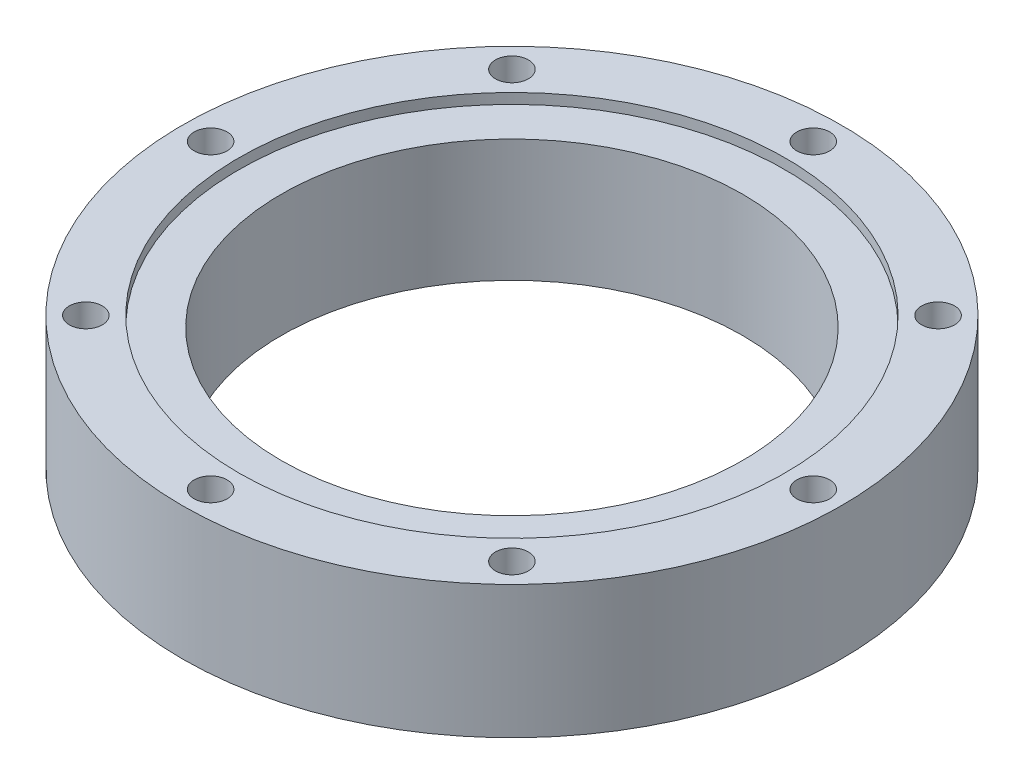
ISO-10303-21;
HEADER;
FILE_DESCRIPTION(('STEP AP214'),'2;1');
FILE_NAME('part.step','',(''),(''),'','','');
FILE_SCHEMA(('AUTOMOTIVE_DESIGN { 1 0 10303 214 1 1 1 1 }'));
ENDSEC;
DATA;
#1=APPLICATION_CONTEXT('core data for automotive mechanical design processes');
#2=APPLICATION_PROTOCOL_DEFINITION('international standard','automotive_design',2000,#1);
#3=PRODUCT_CONTEXT('',#1,'mechanical');
#4=PRODUCT('Part','Part','',(#3));
#5=PRODUCT_RELATED_PRODUCT_CATEGORY('part','',(#4));
#6=PRODUCT_DEFINITION_FORMATION('','',#4);
#7=PRODUCT_DEFINITION_CONTEXT('part definition',#1,'design');
#8=PRODUCT_DEFINITION('design','',#6,#7);
#9=PRODUCT_DEFINITION_SHAPE('','',#8);
#10=(LENGTH_UNIT() NAMED_UNIT(*) SI_UNIT(.MILLI.,.METRE.));
#11=(NAMED_UNIT(*) PLANE_ANGLE_UNIT() SI_UNIT($,.RADIAN.));
#12=(NAMED_UNIT(*) SI_UNIT($,.STERADIAN.) SOLID_ANGLE_UNIT());
#13=UNCERTAINTY_MEASURE_WITH_UNIT(LENGTH_MEASURE(1.E-05),#10,'distance_accuracy_value','');
#14=(GEOMETRIC_REPRESENTATION_CONTEXT(3) GLOBAL_UNCERTAINTY_ASSIGNED_CONTEXT((#13)) GLOBAL_UNIT_ASSIGNED_CONTEXT((#10,
#11,#12)) REPRESENTATION_CONTEXT('',''));
#15=CARTESIAN_POINT('',(0.,0.,0.));
#16=DIRECTION('',(0.,0.,1.));
#17=DIRECTION('',(1.,0.,0.));
#18=AXIS2_PLACEMENT_3D('',#15,#16,#17);
#19=CARTESIAN_POINT('',(0.,14.1,0.));
#20=DIRECTION('',(0.,1.,0.));
#21=DIRECTION('',(0.,0.,1.));
#22=AXIS2_PLACEMENT_3D('',#19,#20,#21);
#23=PLANE('',#22);
#24=CARTESIAN_POINT('',(0.,14.1,-32.));
#25=DIRECTION('',(0.,1.,0.));
#26=DIRECTION('',(0.,0.,1.));
#27=AXIS2_PLACEMENT_3D('',#24,#25,#26);
#28=CIRCLE('',#27,1.75);
#29=CARTESIAN_POINT('',(0.,14.1,-30.25));
#30=VERTEX_POINT('',#29);
#31=EDGE_CURVE('E133',#30,#30,#28,.T.);
#32=ORIENTED_EDGE('',*,*,#31,.F.);
#33=EDGE_LOOP('',(#32));
#34=FACE_BOUND('',#33,.T.);
#35=CARTESIAN_POINT('',(22.6274169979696,14.1,-22.6274169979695));
#36=DIRECTION('',(0.,1.,0.));
#37=DIRECTION('',(0.,0.,1.));
#38=AXIS2_PLACEMENT_3D('',#35,#36,#37);
#39=CIRCLE('',#38,1.75);
#40=CARTESIAN_POINT('',(22.6274169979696,14.1,-20.8774169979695));
#41=VERTEX_POINT('',#40);
#42=EDGE_CURVE('E130',#41,#41,#39,.T.);
#43=ORIENTED_EDGE('',*,*,#42,.F.);
#44=EDGE_LOOP('',(#43));
#45=FACE_BOUND('',#44,.T.);
#46=CARTESIAN_POINT('',(32.,14.1,1.1172740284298E-13));
#47=DIRECTION('',(0.,1.,0.));
#48=DIRECTION('',(0.,0.,1.));
#49=AXIS2_PLACEMENT_3D('',#46,#47,#48);
#50=CIRCLE('',#49,1.75);
#51=CARTESIAN_POINT('',(32.,14.1,1.75000000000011));
#52=VERTEX_POINT('',#51);
#53=EDGE_CURVE('E119',#52,#52,#50,.T.);
#54=ORIENTED_EDGE('',*,*,#53,.F.);
#55=EDGE_LOOP('',(#54));
#56=FACE_BOUND('',#55,.T.);
#57=CARTESIAN_POINT('',(22.6274169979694,14.1,22.6274169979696));
#58=DIRECTION('',(0.,1.,0.));
#59=DIRECTION('',(0.,0.,1.));
#60=AXIS2_PLACEMENT_3D('',#57,#58,#59);
#61=CIRCLE('',#60,1.75);
#62=CARTESIAN_POINT('',(22.6274169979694,14.1,24.3774169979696));
#63=VERTEX_POINT('',#62);
#64=EDGE_CURVE('E112',#63,#63,#61,.T.);
#65=ORIENTED_EDGE('',*,*,#64,.F.);
#66=EDGE_LOOP('',(#65));
#67=FACE_BOUND('',#66,.T.);
#68=CARTESIAN_POINT('',(-2.23454805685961E-13,14.1,32.));
#69=DIRECTION('',(0.,1.,0.));
#70=DIRECTION('',(0.,0.,1.));
#71=AXIS2_PLACEMENT_3D('',#68,#69,#70);
#72=CIRCLE('',#71,1.75);
#73=CARTESIAN_POINT('',(-2.23454805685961E-13,14.1,33.75));
#74=VERTEX_POINT('',#73);
#75=EDGE_CURVE('E103',#74,#74,#72,.T.);
#76=ORIENTED_EDGE('',*,*,#75,.F.);
#77=EDGE_LOOP('',(#76));
#78=FACE_BOUND('',#77,.T.);
#79=CARTESIAN_POINT('',(-22.6274169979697,14.1,22.6274169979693));
#80=DIRECTION('',(0.,1.,0.));
#81=DIRECTION('',(0.,0.,1.));
#82=AXIS2_PLACEMENT_3D('',#79,#80,#81);
#83=CIRCLE('',#82,1.75);
#84=CARTESIAN_POINT('',(-22.6274169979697,14.1,24.3774169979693));
#85=VERTEX_POINT('',#84);
#86=EDGE_CURVE('E92',#85,#85,#83,.T.);
#87=ORIENTED_EDGE('',*,*,#86,.F.);
#88=EDGE_LOOP('',(#87));
#89=FACE_BOUND('',#88,.T.);
#90=CARTESIAN_POINT('',(-32.,14.1,-3.35182208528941E-13));
#91=DIRECTION('',(0.,1.,0.));
#92=DIRECTION('',(0.,0.,1.));
#93=AXIS2_PLACEMENT_3D('',#90,#91,#92);
#94=CIRCLE('',#93,1.75);
#95=CARTESIAN_POINT('',(-32.,14.1,1.74999999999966));
#96=VERTEX_POINT('',#95);
#97=EDGE_CURVE('E87',#96,#96,#94,.T.);
#98=ORIENTED_EDGE('',*,*,#97,.F.);
#99=EDGE_LOOP('',(#98));
#100=FACE_BOUND('',#99,.T.);
#101=CARTESIAN_POINT('',(-22.6274169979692,14.1,-22.6274169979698));
#102=DIRECTION('',(0.,1.,0.));
#103=DIRECTION('',(0.,0.,1.));
#104=AXIS2_PLACEMENT_3D('',#101,#102,#103);
#105=CIRCLE('',#104,1.75);
#106=CARTESIAN_POINT('',(-22.6274169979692,14.1,-20.8774169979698));
#107=VERTEX_POINT('',#106);
#108=EDGE_CURVE('E76',#107,#107,#105,.T.);
#109=ORIENTED_EDGE('',*,*,#108,.F.);
#110=EDGE_LOOP('',(#109));
#111=FACE_BOUND('',#110,.T.);
#112=CARTESIAN_POINT('',(0.,14.1,0.));
#113=DIRECTION('',(0.,1.,0.));
#114=DIRECTION('',(0.,0.,1.));
#115=AXIS2_PLACEMENT_3D('',#112,#113,#114);
#116=CIRCLE('',#115,35.);
#117=CARTESIAN_POINT('',(0.,14.1,35.));
#118=VERTEX_POINT('',#117);
#119=EDGE_CURVE('E60',#118,#118,#116,.T.);
#120=ORIENTED_EDGE('',*,*,#119,.T.);
#121=EDGE_LOOP('',(#120));
#122=FACE_BOUND('',#121,.T.);
#123=CARTESIAN_POINT('',(0.,14.1,0.));
#124=DIRECTION('',(0.,1.,0.));
#125=DIRECTION('',(0.,0.,1.));
#126=AXIS2_PLACEMENT_3D('',#123,#124,#125);
#127=CIRCLE('',#126,29.);
#128=CARTESIAN_POINT('',(0.,14.1,29.));
#129=VERTEX_POINT('',#128);
#130=EDGE_CURVE('E66',#129,#129,#127,.T.);
#131=ORIENTED_EDGE('',*,*,#130,.F.);
#132=EDGE_LOOP('',(#131));
#133=FACE_BOUND('',#132,.T.);
#134=ADVANCED_FACE('F47',(#34,#45,#56,#67,#78,#89,#100,#111,#122,#133),#23,.T.);
#135=CARTESIAN_POINT('',(0.,0.,0.));
#136=DIRECTION('',(0.,1.,0.));
#137=DIRECTION('',(0.,0.,1.));
#138=AXIS2_PLACEMENT_3D('',#135,#136,#137);
#139=PLANE('',#138);
#140=CARTESIAN_POINT('',(29.5641450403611,0.,12.245869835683));
#141=DIRECTION('',(0.,-1.,0.));
#142=DIRECTION('',(0.,0.,-1.));
#143=AXIS2_PLACEMENT_3D('',#140,#141,#142);
#144=CIRCLE('',#143,1.5);
#145=CARTESIAN_POINT('',(29.5641450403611,0.,10.745869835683));
#146=VERTEX_POINT('',#145);
#147=EDGE_CURVE('E152',#146,#146,#144,.T.);
#148=ORIENTED_EDGE('',*,*,#147,.F.);
#149=EDGE_LOOP('',(#148));
#150=FACE_BOUND('',#149,.T.);
#151=CARTESIAN_POINT('',(-29.5641450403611,0.,-12.245869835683));
#152=DIRECTION('',(0.,-1.,0.));
#153=DIRECTION('',(0.,0.,-1.));
#154=AXIS2_PLACEMENT_3D('',#151,#152,#153);
#155=CIRCLE('',#154,1.5);
#156=CARTESIAN_POINT('',(-29.5641450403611,0.,-13.745869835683));
#157=VERTEX_POINT('',#156);
#158=EDGE_CURVE('E147',#157,#157,#155,.T.);
#159=ORIENTED_EDGE('',*,*,#158,.F.);
#160=EDGE_LOOP('',(#159));
#161=FACE_BOUND('',#160,.T.);
#162=CARTESIAN_POINT('',(0.,0.,-32.));
#163=DIRECTION('',(0.,1.,0.));
#164=DIRECTION('',(0.,0.,1.));
#165=AXIS2_PLACEMENT_3D('',#162,#163,#164);
#166=CIRCLE('',#165,1.75);
#167=CARTESIAN_POINT('',(0.,0.,-30.25));
#168=VERTEX_POINT('',#167);
#169=EDGE_CURVE('E71',#168,#168,#166,.T.);
#170=ORIENTED_EDGE('',*,*,#169,.T.);
#171=EDGE_LOOP('',(#170));
#172=FACE_BOUND('',#171,.T.);
#173=CARTESIAN_POINT('',(22.6274169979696,0.,-22.6274169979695));
#174=DIRECTION('',(0.,1.,0.));
#175=DIRECTION('',(0.,0.,1.));
#176=AXIS2_PLACEMENT_3D('',#173,#174,#175);
#177=CIRCLE('',#176,1.75);
#178=CARTESIAN_POINT('',(22.6274169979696,0.,-20.8774169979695));
#179=VERTEX_POINT('',#178);
#180=EDGE_CURVE('E121',#179,#179,#177,.T.);
#181=ORIENTED_EDGE('',*,*,#180,.T.);
#182=EDGE_LOOP('',(#181));
#183=FACE_BOUND('',#182,.T.);
#184=CARTESIAN_POINT('',(32.,0.,1.1172740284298E-13));
#185=DIRECTION('',(0.,1.,0.));
#186=DIRECTION('',(0.,0.,1.));
#187=AXIS2_PLACEMENT_3D('',#184,#185,#186);
#188=CIRCLE('',#187,1.75);
#189=CARTESIAN_POINT('',(32.,0.,1.75000000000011));
#190=VERTEX_POINT('',#189);
#191=EDGE_CURVE('E113',#190,#190,#188,.T.);
#192=ORIENTED_EDGE('',*,*,#191,.T.);
#193=EDGE_LOOP('',(#192));
#194=FACE_BOUND('',#193,.T.);
#195=CARTESIAN_POINT('',(22.6274169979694,0.,22.6274169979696));
#196=DIRECTION('',(0.,1.,0.));
#197=DIRECTION('',(0.,0.,1.));
#198=AXIS2_PLACEMENT_3D('',#195,#196,#197);
#199=CIRCLE('',#198,1.75);
#200=CARTESIAN_POINT('',(22.6274169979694,0.,24.3774169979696));
#201=VERTEX_POINT('',#200);
#202=EDGE_CURVE('E110',#201,#201,#199,.T.);
#203=ORIENTED_EDGE('',*,*,#202,.T.);
#204=EDGE_LOOP('',(#203));
#205=FACE_BOUND('',#204,.T.);
#206=CARTESIAN_POINT('',(-2.23454805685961E-13,0.,32.));
#207=DIRECTION('',(0.,1.,0.));
#208=DIRECTION('',(0.,0.,1.));
#209=AXIS2_PLACEMENT_3D('',#206,#207,#208);
#210=CIRCLE('',#209,1.75);
#211=CARTESIAN_POINT('',(-2.23454805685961E-13,0.,33.75));
#212=VERTEX_POINT('',#211);
#213=EDGE_CURVE('E97',#212,#212,#210,.T.);
#214=ORIENTED_EDGE('',*,*,#213,.T.);
#215=EDGE_LOOP('',(#214));
#216=FACE_BOUND('',#215,.T.);
#217=CARTESIAN_POINT('',(-22.6274169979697,0.,22.6274169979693));
#218=DIRECTION('',(0.,1.,0.));
#219=DIRECTION('',(0.,0.,1.));
#220=AXIS2_PLACEMENT_3D('',#217,#218,#219);
#221=CIRCLE('',#220,1.75);
#222=CARTESIAN_POINT('',(-22.6274169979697,0.,24.3774169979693));
#223=VERTEX_POINT('',#222);
#224=EDGE_CURVE('E93',#223,#223,#221,.T.);
#225=ORIENTED_EDGE('',*,*,#224,.T.);
#226=EDGE_LOOP('',(#225));
#227=FACE_BOUND('',#226,.T.);
#228=CARTESIAN_POINT('',(-32.,0.,-3.35182208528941E-13));
#229=DIRECTION('',(0.,1.,0.));
#230=DIRECTION('',(0.,0.,1.));
#231=AXIS2_PLACEMENT_3D('',#228,#229,#230);
#232=CIRCLE('',#231,1.75);
#233=CARTESIAN_POINT('',(-32.,0.,1.74999999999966));
#234=VERTEX_POINT('',#233);
#235=EDGE_CURVE('E81',#234,#234,#232,.T.);
#236=ORIENTED_EDGE('',*,*,#235,.T.);
#237=EDGE_LOOP('',(#236));
#238=FACE_BOUND('',#237,.T.);
#239=CARTESIAN_POINT('',(-22.6274169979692,0.,-22.6274169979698));
#240=DIRECTION('',(0.,1.,0.));
#241=DIRECTION('',(0.,0.,1.));
#242=AXIS2_PLACEMENT_3D('',#239,#240,#241);
#243=CIRCLE('',#242,1.75);
#244=CARTESIAN_POINT('',(-22.6274169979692,0.,-20.8774169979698));
#245=VERTEX_POINT('',#244);
#246=EDGE_CURVE('E74',#245,#245,#243,.T.);
#247=ORIENTED_EDGE('',*,*,#246,.T.);
#248=EDGE_LOOP('',(#247));
#249=FACE_BOUND('',#248,.T.);
#250=CARTESIAN_POINT('',(0.,0.,0.));
#251=DIRECTION('',(0.,1.,0.));
#252=DIRECTION('',(0.,0.,1.));
#253=AXIS2_PLACEMENT_3D('',#250,#251,#252);
#254=CIRCLE('',#253,35.);
#255=CARTESIAN_POINT('',(0.,0.,35.));
#256=VERTEX_POINT('',#255);
#257=EDGE_CURVE('E65',#256,#256,#254,.T.);
#258=ORIENTED_EDGE('',*,*,#257,.F.);
#259=EDGE_LOOP('',(#258));
#260=FACE_BOUND('',#259,.T.);
#261=CARTESIAN_POINT('',(0.,0.,0.));
#262=DIRECTION('',(0.,1.,0.));
#263=DIRECTION('',(0.,0.,1.));
#264=AXIS2_PLACEMENT_3D('',#261,#262,#263);
#265=CIRCLE('',#264,24.5);
#266=CARTESIAN_POINT('',(0.,0.,-24.5));
#267=VERTEX_POINT('',#266);
#268=EDGE_CURVE('E136',#267,#267,#265,.T.);
#269=ORIENTED_EDGE('',*,*,#268,.T.);
#270=EDGE_LOOP('',(#269));
#271=FACE_BOUND('',#270,.T.);
#272=ADVANCED_FACE('F173',(#150,#161,#172,#183,#194,#205,#216,#227,#238,#249,#260,#271),#139,.F.);
#273=CARTESIAN_POINT('',(0.,14.1,0.));
#274=DIRECTION('',(0.,-1.,0.));
#275=DIRECTION('',(0.,0.,-1.));
#276=AXIS2_PLACEMENT_3D('',#273,#274,#275);
#277=CYLINDRICAL_SURFACE('',#276,35.);
#278=ORIENTED_EDGE('',*,*,#119,.F.);
#279=EDGE_LOOP('',(#278));
#280=FACE_BOUND('',#279,.T.);
#281=ORIENTED_EDGE('',*,*,#257,.T.);
#282=EDGE_LOOP('',(#281));
#283=FACE_BOUND('',#282,.T.);
#284=ADVANCED_FACE('F51',(#280,#283),#277,.T.);
#285=CARTESIAN_POINT('',(0.,14.1,0.));
#286=DIRECTION('',(0.,-1.,0.));
#287=DIRECTION('',(0.,0.,-1.));
#288=AXIS2_PLACEMENT_3D('',#285,#286,#287);
#289=CYLINDRICAL_SURFACE('',#288,29.);
#290=CARTESIAN_POINT('',(0.,13.,0.));
#291=DIRECTION('',(0.,1.,0.));
#292=DIRECTION('',(0.,0.,1.));
#293=AXIS2_PLACEMENT_3D('',#290,#291,#292);
#294=CIRCLE('',#293,29.);
#295=CARTESIAN_POINT('',(0.,13.,29.));
#296=VERTEX_POINT('',#295);
#297=EDGE_CURVE('E10',#296,#296,#294,.T.);
#298=ORIENTED_EDGE('',*,*,#297,.F.);
#299=EDGE_LOOP('',(#298));
#300=FACE_BOUND('',#299,.T.);
#301=ORIENTED_EDGE('',*,*,#130,.T.);
#302=EDGE_LOOP('',(#301));
#303=FACE_BOUND('',#302,.T.);
#304=ADVANCED_FACE('F218',(#300,#303),#289,.F.);
#305=CARTESIAN_POINT('',(-22.6274169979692,0.,-22.6274169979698));
#306=DIRECTION('',(0.,1.,0.));
#307=DIRECTION('',(0.,0.,1.));
#308=AXIS2_PLACEMENT_3D('',#305,#306,#307);
#309=CYLINDRICAL_SURFACE('',#308,1.75);
#310=ORIENTED_EDGE('',*,*,#246,.F.);
#311=EDGE_LOOP('',(#310));
#312=FACE_BOUND('',#311,.T.);
#313=ORIENTED_EDGE('',*,*,#108,.T.);
#314=EDGE_LOOP('',(#313));
#315=FACE_BOUND('',#314,.T.);
#316=ADVANCED_FACE('F225',(#312,#315),#309,.F.);
#317=CARTESIAN_POINT('',(-32.,0.,-3.35182208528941E-13));
#318=DIRECTION('',(0.,1.,0.));
#319=DIRECTION('',(0.,0.,1.));
#320=AXIS2_PLACEMENT_3D('',#317,#318,#319);
#321=CYLINDRICAL_SURFACE('',#320,1.75);
#322=ORIENTED_EDGE('',*,*,#235,.F.);
#323=EDGE_LOOP('',(#322));
#324=FACE_BOUND('',#323,.T.);
#325=ORIENTED_EDGE('',*,*,#97,.T.);
#326=EDGE_LOOP('',(#325));
#327=FACE_BOUND('',#326,.T.);
#328=ADVANCED_FACE('F228',(#324,#327),#321,.F.);
#329=CARTESIAN_POINT('',(-22.6274169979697,0.,22.6274169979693));
#330=DIRECTION('',(0.,1.,0.));
#331=DIRECTION('',(0.,0.,1.));
#332=AXIS2_PLACEMENT_3D('',#329,#330,#331);
#333=CYLINDRICAL_SURFACE('',#332,1.75);
#334=ORIENTED_EDGE('',*,*,#224,.F.);
#335=EDGE_LOOP('',(#334));
#336=FACE_BOUND('',#335,.T.);
#337=ORIENTED_EDGE('',*,*,#86,.T.);
#338=EDGE_LOOP('',(#337));
#339=FACE_BOUND('',#338,.T.);
#340=ADVANCED_FACE('F227',(#336,#339),#333,.F.);
#341=CARTESIAN_POINT('',(-2.23454805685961E-13,0.,32.));
#342=DIRECTION('',(0.,1.,0.));
#343=DIRECTION('',(0.,0.,1.));
#344=AXIS2_PLACEMENT_3D('',#341,#342,#343);
#345=CYLINDRICAL_SURFACE('',#344,1.75);
#346=ORIENTED_EDGE('',*,*,#213,.F.);
#347=EDGE_LOOP('',(#346));
#348=FACE_BOUND('',#347,.T.);
#349=ORIENTED_EDGE('',*,*,#75,.T.);
#350=EDGE_LOOP('',(#349));
#351=FACE_BOUND('',#350,.T.);
#352=ADVANCED_FACE('F232',(#348,#351),#345,.F.);
#353=CARTESIAN_POINT('',(22.6274169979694,0.,22.6274169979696));
#354=DIRECTION('',(0.,1.,0.));
#355=DIRECTION('',(0.,0.,1.));
#356=AXIS2_PLACEMENT_3D('',#353,#354,#355);
#357=CYLINDRICAL_SURFACE('',#356,1.75);
#358=ORIENTED_EDGE('',*,*,#202,.F.);
#359=EDGE_LOOP('',(#358));
#360=FACE_BOUND('',#359,.T.);
#361=ORIENTED_EDGE('',*,*,#64,.T.);
#362=EDGE_LOOP('',(#361));
#363=FACE_BOUND('',#362,.T.);
#364=ADVANCED_FACE('F236',(#360,#363),#357,.F.);
#365=CARTESIAN_POINT('',(32.,0.,1.1172740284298E-13));
#366=DIRECTION('',(0.,1.,0.));
#367=DIRECTION('',(0.,0.,1.));
#368=AXIS2_PLACEMENT_3D('',#365,#366,#367);
#369=CYLINDRICAL_SURFACE('',#368,1.75);
#370=ORIENTED_EDGE('',*,*,#191,.F.);
#371=EDGE_LOOP('',(#370));
#372=FACE_BOUND('',#371,.T.);
#373=ORIENTED_EDGE('',*,*,#53,.T.);
#374=EDGE_LOOP('',(#373));
#375=FACE_BOUND('',#374,.T.);
#376=ADVANCED_FACE('F245',(#372,#375),#369,.F.);
#377=CARTESIAN_POINT('',(22.6274169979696,0.,-22.6274169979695));
#378=DIRECTION('',(0.,1.,0.));
#379=DIRECTION('',(0.,0.,1.));
#380=AXIS2_PLACEMENT_3D('',#377,#378,#379);
#381=CYLINDRICAL_SURFACE('',#380,1.75);
#382=ORIENTED_EDGE('',*,*,#180,.F.);
#383=EDGE_LOOP('',(#382));
#384=FACE_BOUND('',#383,.T.);
#385=ORIENTED_EDGE('',*,*,#42,.T.);
#386=EDGE_LOOP('',(#385));
#387=FACE_BOUND('',#386,.T.);
#388=ADVANCED_FACE('F248',(#384,#387),#381,.F.);
#389=CARTESIAN_POINT('',(0.,0.,-32.));
#390=DIRECTION('',(0.,1.,0.));
#391=DIRECTION('',(0.,0.,1.));
#392=AXIS2_PLACEMENT_3D('',#389,#390,#391);
#393=CYLINDRICAL_SURFACE('',#392,1.75);
#394=ORIENTED_EDGE('',*,*,#169,.F.);
#395=EDGE_LOOP('',(#394));
#396=FACE_BOUND('',#395,.T.);
#397=ORIENTED_EDGE('',*,*,#31,.T.);
#398=EDGE_LOOP('',(#397));
#399=FACE_BOUND('',#398,.T.);
#400=ADVANCED_FACE('F208',(#396,#399),#393,.F.);
#401=CARTESIAN_POINT('',(0.,13.,0.));
#402=DIRECTION('',(0.,1.,0.));
#403=DIRECTION('',(0.,0.,1.));
#404=AXIS2_PLACEMENT_3D('',#401,#402,#403);
#405=PLANE('',#404);
#406=ORIENTED_EDGE('',*,*,#297,.T.);
#407=EDGE_LOOP('',(#406));
#408=FACE_BOUND('',#407,.T.);
#409=CARTESIAN_POINT('',(0.,13.,0.));
#410=DIRECTION('',(0.,1.,0.));
#411=DIRECTION('',(0.,0.,1.));
#412=AXIS2_PLACEMENT_3D('',#409,#410,#411);
#413=CIRCLE('',#412,24.5);
#414=CARTESIAN_POINT('',(0.,13.,-24.5));
#415=VERTEX_POINT('',#414);
#416=EDGE_CURVE('E79',#415,#415,#413,.T.);
#417=ORIENTED_EDGE('',*,*,#416,.F.);
#418=EDGE_LOOP('',(#417));
#419=FACE_BOUND('',#418,.T.);
#420=ADVANCED_FACE('F200',(#408,#419),#405,.T.);
#421=CARTESIAN_POINT('',(0.,13.,0.));
#422=DIRECTION('',(0.,-1.,0.));
#423=DIRECTION('',(0.,0.,-1.));
#424=AXIS2_PLACEMENT_3D('',#421,#422,#423);
#425=CYLINDRICAL_SURFACE('',#424,24.5);
#426=CARTESIAN_POINT('',(0.,13.,-24.5));
#427=CARTESIAN_POINT('',(0.,12.8645833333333,-24.5));
#428=CARTESIAN_POINT('',(0.,12.7291666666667,-24.5));
#429=CARTESIAN_POINT('',(0.,12.4583333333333,-24.5));
#430=CARTESIAN_POINT('',(0.,12.3229166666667,-24.5));
#431=CARTESIAN_POINT('',(0.,12.0520833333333,-24.5));
#432=CARTESIAN_POINT('',(0.,11.9166666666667,-24.5));
#433=CARTESIAN_POINT('',(0.,11.6458333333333,-24.5));
#434=CARTESIAN_POINT('',(0.,11.5104166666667,-24.5));
#435=CARTESIAN_POINT('',(0.,11.2395833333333,-24.5));
#436=CARTESIAN_POINT('',(0.,11.1041666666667,-24.5));
#437=CARTESIAN_POINT('',(0.,10.8333333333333,-24.5));
#438=CARTESIAN_POINT('',(0.,10.6979166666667,-24.5));
#439=CARTESIAN_POINT('',(0.,10.4270833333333,-24.5));
#440=CARTESIAN_POINT('',(0.,10.2916666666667,-24.5));
#441=CARTESIAN_POINT('',(0.,10.0208333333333,-24.5));
#442=CARTESIAN_POINT('',(0.,9.88541666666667,-24.5));
#443=CARTESIAN_POINT('',(0.,9.61458333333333,-24.5));
#444=CARTESIAN_POINT('',(0.,9.47916666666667,-24.5));
#445=CARTESIAN_POINT('',(0.,9.20833333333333,-24.5));
#446=CARTESIAN_POINT('',(0.,9.07291666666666,-24.5));
#447=CARTESIAN_POINT('',(0.,8.80208333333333,-24.5));
#448=CARTESIAN_POINT('',(0.,8.66666666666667,-24.5));
#449=CARTESIAN_POINT('',(0.,8.39583333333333,-24.5));
#450=CARTESIAN_POINT('',(0.,8.26041666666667,-24.5));
#451=CARTESIAN_POINT('',(0.,7.98958333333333,-24.5));
#452=CARTESIAN_POINT('',(0.,7.85416666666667,-24.5));
#453=CARTESIAN_POINT('',(0.,7.58333333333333,-24.5));
#454=CARTESIAN_POINT('',(0.,7.44791666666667,-24.5));
#455=CARTESIAN_POINT('',(0.,7.17708333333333,-24.5));
#456=CARTESIAN_POINT('',(0.,7.04166666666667,-24.5));
#457=CARTESIAN_POINT('',(0.,6.77083333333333,-24.5));
#458=CARTESIAN_POINT('',(0.,6.63541666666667,-24.5));
#459=CARTESIAN_POINT('',(0.,6.36458333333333,-24.5));
#460=CARTESIAN_POINT('',(0.,6.22916666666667,-24.5));
#461=CARTESIAN_POINT('',(0.,5.95833333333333,-24.5));
#462=CARTESIAN_POINT('',(0.,5.82291666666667,-24.5));
#463=CARTESIAN_POINT('',(0.,5.55208333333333,-24.5));
#464=CARTESIAN_POINT('',(0.,5.41666666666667,-24.5));
#465=CARTESIAN_POINT('',(0.,5.14583333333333,-24.5));
#466=CARTESIAN_POINT('',(0.,5.01041666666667,-24.5));
#467=CARTESIAN_POINT('',(0.,4.73958333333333,-24.5));
#468=CARTESIAN_POINT('',(0.,4.60416666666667,-24.5));
#469=CARTESIAN_POINT('',(0.,4.33333333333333,-24.5));
#470=CARTESIAN_POINT('',(0.,4.19791666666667,-24.5));
#471=CARTESIAN_POINT('',(0.,3.92708333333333,-24.5));
#472=CARTESIAN_POINT('',(0.,3.79166666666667,-24.5));
#473=CARTESIAN_POINT('',(0.,3.52083333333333,-24.5));
#474=CARTESIAN_POINT('',(0.,3.38541666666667,-24.5));
#475=CARTESIAN_POINT('',(0.,3.11458333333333,-24.5));
#476=CARTESIAN_POINT('',(0.,2.97916666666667,-24.5));
#477=CARTESIAN_POINT('',(0.,2.70833333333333,-24.5));
#478=CARTESIAN_POINT('',(0.,2.57291666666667,-24.5));
#479=CARTESIAN_POINT('',(0.,2.30208333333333,-24.5));
#480=CARTESIAN_POINT('',(0.,2.16666666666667,-24.5));
#481=CARTESIAN_POINT('',(0.,1.89583333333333,-24.5));
#482=CARTESIAN_POINT('',(0.,1.76041666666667,-24.5));
#483=CARTESIAN_POINT('',(0.,1.48958333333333,-24.5));
#484=CARTESIAN_POINT('',(0.,1.35416666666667,-24.5));
#485=CARTESIAN_POINT('',(0.,1.08333333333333,-24.5));
#486=CARTESIAN_POINT('',(0.,0.947916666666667,-24.5));
#487=CARTESIAN_POINT('',(0.,0.677083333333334,-24.5));
#488=CARTESIAN_POINT('',(0.,0.541666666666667,-24.5));
#489=CARTESIAN_POINT('',(0.,0.270833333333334,-24.5));
#490=CARTESIAN_POINT('',(0.,0.135416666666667,-24.5));
#491=CARTESIAN_POINT('',(0.,0.,-24.5));
#492=B_SPLINE_CURVE_WITH_KNOTS('',3,(#426,#427,#428,#429,#430,#431,#432,#433,#434,#435,#436,
#437,#438,#439,#440,#441,#442,#443,#444,#445,#446,#447,#448,#449,#450,#451,#452,#453,#454,#455,
#456,#457,#458,#459,#460,#461,#462,#463,#464,#465,#466,#467,#468,#469,#470,#471,#472,#473,#474,
#475,#476,#477,#478,#479,#480,#481,#482,#483,#484,#485,#486,#487,#488,#489,#490,#491),
.UNSPECIFIED.,.F.,.F.,(4,2,2,2,2,2,2,2,2,2,2,2,2,2,2,2,2,2,2,2,2,2,2,2,2,2,2,2,2,2,2,2,4),(0.,
0.40625,0.812500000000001,1.21875,1.625,2.03125,2.4375,2.84375,3.25,3.65625,4.0625,4.46875,
4.875,5.28125,5.6875,6.09375,6.5,6.90625,7.3125,7.71875,8.125,8.53125,8.9375,9.34375,9.75,
10.15625,10.5625,10.96875,11.375,11.78125,12.1875,12.59375,13.),.UNSPECIFIED.);
#493=EDGE_CURVE('BSEAM198',#415,#267,#492,.T.);
#494=ORIENTED_EDGE('',*,*,#416,.T.);
#495=ORIENTED_EDGE('',*,*,#268,.F.);
#496=ORIENTED_EDGE('',*,*,#493,.T.);
#497=ORIENTED_EDGE('',*,*,#493,.F.);
#498=EDGE_LOOP('',(#494,#496,#495,#497));
#499=FACE_BOUND('',#498,.T.);
#500=ADVANCED_FACE('F198',(#499),#425,.F.);
#501=CARTESIAN_POINT('',(-29.5641450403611,5.,-12.245869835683));
#502=DIRECTION('',(0.,-1.,0.));
#503=DIRECTION('',(0.,0.,-1.));
#504=AXIS2_PLACEMENT_3D('',#501,#502,#503);
#505=CYLINDRICAL_SURFACE('',#504,1.5);
#506=CARTESIAN_POINT('',(-29.5641450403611,5.,-12.245869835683));
#507=DIRECTION('',(0.,-1.,0.));
#508=DIRECTION('',(0.,0.,-1.));
#509=AXIS2_PLACEMENT_3D('',#506,#507,#508);
#510=CIRCLE('',#509,1.5);
#511=CARTESIAN_POINT('',(-29.5641450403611,5.,-13.745869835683));
#512=VERTEX_POINT('',#511);
#513=EDGE_CURVE('E148',#512,#512,#510,.T.);
#514=ORIENTED_EDGE('',*,*,#513,.F.);
#515=EDGE_LOOP('',(#514));
#516=FACE_BOUND('',#515,.T.);
#517=ORIENTED_EDGE('',*,*,#158,.T.);
#518=EDGE_LOOP('',(#517));
#519=FACE_BOUND('',#518,.T.);
#520=ADVANCED_FACE('F196',(#516,#519),#505,.F.);
#521=CARTESIAN_POINT('',(-29.5641450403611,5.,-12.245869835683));
#522=DIRECTION('',(0.,-1.,0.));
#523=DIRECTION('',(0.,0.,-1.));
#524=AXIS2_PLACEMENT_3D('',#521,#522,#523);
#525=PLANE('',#524);
#526=ORIENTED_EDGE('',*,*,#513,.T.);
#527=EDGE_LOOP('',(#526));
#528=FACE_BOUND('',#527,.T.);
#529=ADVANCED_FACE('F170',(#528),#525,.T.);
#530=CARTESIAN_POINT('',(29.5641450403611,5.,12.245869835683));
#531=DIRECTION('',(0.,-1.,0.));
#532=DIRECTION('',(0.,0.,-1.));
#533=AXIS2_PLACEMENT_3D('',#530,#531,#532);
#534=CYLINDRICAL_SURFACE('',#533,1.5);
#535=CARTESIAN_POINT('',(29.5641450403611,5.,12.245869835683));
#536=DIRECTION('',(0.,-1.,0.));
#537=DIRECTION('',(0.,0.,-1.));
#538=AXIS2_PLACEMENT_3D('',#535,#536,#537);
#539=CIRCLE('',#538,1.5);
#540=CARTESIAN_POINT('',(29.5641450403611,5.,10.745869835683));
#541=VERTEX_POINT('',#540);
#542=EDGE_CURVE('E142',#541,#541,#539,.T.);
#543=ORIENTED_EDGE('',*,*,#542,.F.);
#544=EDGE_LOOP('',(#543));
#545=FACE_BOUND('',#544,.T.);
#546=ORIENTED_EDGE('',*,*,#147,.T.);
#547=EDGE_LOOP('',(#546));
#548=FACE_BOUND('',#547,.T.);
#549=ADVANCED_FACE('F163',(#545,#548),#534,.F.);
#550=CARTESIAN_POINT('',(29.5641450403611,5.,12.245869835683));
#551=DIRECTION('',(0.,-1.,0.));
#552=DIRECTION('',(0.,0.,-1.));
#553=AXIS2_PLACEMENT_3D('',#550,#551,#552);
#554=PLANE('',#553);
#555=ORIENTED_EDGE('',*,*,#542,.T.);
#556=EDGE_LOOP('',(#555));
#557=FACE_BOUND('',#556,.T.);
#558=ADVANCED_FACE('F165',(#557),#554,.T.);
#559=CLOSED_SHELL('',(#134,#272,#284,#304,#316,#328,#340,#352,#364,#376,#388,#400,#420,#500,
#520,#529,#549,#558));
#560=MANIFOLD_SOLID_BREP('B2',#559);
#561=ADVANCED_BREP_SHAPE_REPRESENTATION('',(#18,#560),#14);
#562=SHAPE_DEFINITION_REPRESENTATION(#9,#561);
ENDSEC;
END-ISO-10303-21;
